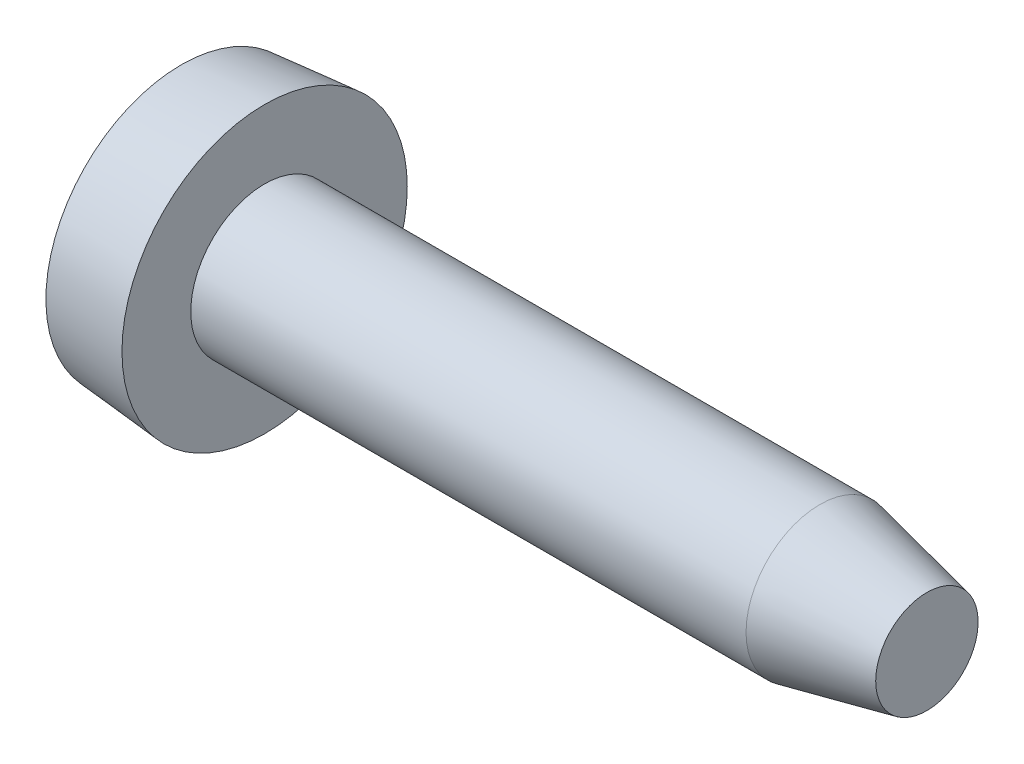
ISO-10303-21;
HEADER;
FILE_DESCRIPTION(('STEP AP214'),'2;1');
FILE_NAME('part.step','',(''),(''),'','','');
FILE_SCHEMA(('AUTOMOTIVE_DESIGN { 1 0 10303 214 1 1 1 1 }'));
ENDSEC;
DATA;
#1=APPLICATION_CONTEXT('core data for automotive mechanical design processes');
#2=APPLICATION_PROTOCOL_DEFINITION('international standard','automotive_design',2000,#1);
#3=PRODUCT_CONTEXT('',#1,'mechanical');
#4=PRODUCT('Part','Part','',(#3));
#5=PRODUCT_RELATED_PRODUCT_CATEGORY('part','',(#4));
#6=PRODUCT_DEFINITION_FORMATION('','',#4);
#7=PRODUCT_DEFINITION_CONTEXT('part definition',#1,'design');
#8=PRODUCT_DEFINITION('design','',#6,#7);
#9=PRODUCT_DEFINITION_SHAPE('','',#8);
#10=(LENGTH_UNIT() NAMED_UNIT(*) SI_UNIT(.MILLI.,.METRE.));
#11=(NAMED_UNIT(*) PLANE_ANGLE_UNIT() SI_UNIT($,.RADIAN.));
#12=(NAMED_UNIT(*) SI_UNIT($,.STERADIAN.) SOLID_ANGLE_UNIT());
#13=UNCERTAINTY_MEASURE_WITH_UNIT(LENGTH_MEASURE(1.E-05),#10,'distance_accuracy_value','');
#14=(GEOMETRIC_REPRESENTATION_CONTEXT(3) GLOBAL_UNCERTAINTY_ASSIGNED_CONTEXT((#13)) GLOBAL_UNIT_ASSIGNED_CONTEXT((#10,
#11,#12)) REPRESENTATION_CONTEXT('',''));
#15=CARTESIAN_POINT('',(0.,0.,0.));
#16=DIRECTION('',(0.,0.,1.));
#17=DIRECTION('',(1.,0.,0.));
#18=AXIS2_PLACEMENT_3D('',#15,#16,#17);
#19=CARTESIAN_POINT('',(-1.70366554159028,0.,-0.255));
#20=DIRECTION('',(0.,0.,1.));
#21=DIRECTION('',(1.,0.,0.));
#22=AXIS2_PLACEMENT_3D('',#19,#20,#21);
#23=PLANE('',#22);
#24=CARTESIAN_POINT('',(-2.38697804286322,-0.254999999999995,-0.255));
#25=CARTESIAN_POINT('',(-2.38080941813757,-0.375863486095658,-0.255000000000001));
#26=CARTESIAN_POINT('',(-2.37022720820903,-0.496488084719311,-0.255));
#27=CARTESIAN_POINT('',(-2.34040446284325,-0.736102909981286,-0.255));
#28=CARTESIAN_POINT('',(-2.321203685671,-0.855098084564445,-0.254999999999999));
#29=CARTESIAN_POINT('',(-2.26269549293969,-1.14959225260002,-0.255));
#30=CARTESIAN_POINT('',(-2.21814295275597,-1.32406276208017,-0.255000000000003));
#31=CARTESIAN_POINT('',(-2.16423628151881,-1.4956696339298,-0.25500000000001));
#32=B_SPLINE_CURVE_WITH_KNOTS('',3,(#24,#25,#26,#27,#28,#29,#30,#31),.UNSPECIFIED.,.F.,.F.,(4,2,
2,4),(0.,0.362956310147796,0.724255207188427,1.26345566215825),.UNSPECIFIED.);
#33=CARTESIAN_POINT('',(-2.38697804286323,-0.254999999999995,-0.255));
#34=VERTEX_POINT('',#33);
#35=CARTESIAN_POINT('',(-2.16423628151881,-1.49566963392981,-0.255000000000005));
#36=VERTEX_POINT('',#35);
#37=EDGE_CURVE('E19',#34,#36,#32,.T.);
#38=ORIENTED_EDGE('',*,*,#37,.T.);
#39=DIRECTION('',(0.78348098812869,0.621415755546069,0.));
#40=VECTOR('',#39,1.);
#41=CARTESIAN_POINT('',(-0.599999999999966,-0.254999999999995,-0.255));
#42=LINE('',#41,#40);
#43=CARTESIAN_POINT('',(-0.599999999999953,-0.254999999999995,-0.254999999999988));
#44=VERTEX_POINT('',#43);
#45=EDGE_CURVE('E79',#36,#44,#42,.T.);
#46=ORIENTED_EDGE('',*,*,#45,.T.);
#47=DIRECTION('',(1.,0.,0.));
#48=VECTOR('',#47,1.);
#49=CARTESIAN_POINT('',(-1.70366554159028,-0.254999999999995,-0.255));
#50=LINE('',#49,#48);
#51=EDGE_CURVE('E221',#44,#34,#50,.F.);
#52=ORIENTED_EDGE('',*,*,#51,.T.);
#53=EDGE_LOOP('',(#38,#46,#52));
#54=FACE_BOUND('',#53,.T.);
#55=ADVANCED_FACE('F15',(#54),#23,.T.);
#56=CARTESIAN_POINT('',(-1.70366554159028,-0.254999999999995,0.));
#57=DIRECTION('',(0.,-1.,0.));
#58=DIRECTION('',(0.,0.,-1.));
#59=AXIS2_PLACEMENT_3D('',#56,#57,#58);
#60=PLANE('',#59);
#61=ORIENTED_EDGE('',*,*,#51,.F.);
#62=DIRECTION('',(-0.78348098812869,0.,-0.621415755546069));
#63=VECTOR('',#62,1.);
#64=CARTESIAN_POINT('',(-0.599999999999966,-0.254999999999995,-0.254999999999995));
#65=LINE('',#64,#63);
#66=CARTESIAN_POINT('',(-2.16423628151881,-0.255,-1.49566963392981));
#67=VERTEX_POINT('',#66);
#68=EDGE_CURVE('E291',#44,#67,#65,.T.);
#69=ORIENTED_EDGE('',*,*,#68,.T.);
#70=CARTESIAN_POINT('',(-2.38697804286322,-0.254999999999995,-0.255));
#71=CARTESIAN_POINT('',(-2.38080941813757,-0.254999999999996,-0.375863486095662));
#72=CARTESIAN_POINT('',(-2.37022720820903,-0.254999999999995,-0.496488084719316));
#73=CARTESIAN_POINT('',(-2.34040446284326,-0.254999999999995,-0.736102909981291));
#74=CARTESIAN_POINT('',(-2.321203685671,-0.254999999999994,-0.85509808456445));
#75=CARTESIAN_POINT('',(-2.2626954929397,-0.254999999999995,-1.14959225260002));
#76=CARTESIAN_POINT('',(-2.21814295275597,-0.254999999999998,-1.32406276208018));
#77=CARTESIAN_POINT('',(-2.16423628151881,-0.255000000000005,-1.4956696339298));
#78=B_SPLINE_CURVE_WITH_KNOTS('',3,(#70,#71,#72,#73,#74,#75,#76,#77),.UNSPECIFIED.,.F.,.F.,(4,2,
2,4),(0.,0.362956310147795,0.724255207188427,1.26345566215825),.UNSPECIFIED.);
#79=EDGE_CURVE('E216',#34,#67,#78,.T.);
#80=ORIENTED_EDGE('',*,*,#79,.F.);
#81=EDGE_LOOP('',(#61,#69,#80));
#82=FACE_BOUND('',#81,.T.);
#83=ADVANCED_FACE('F222',(#82),#60,.F.);
#84=CARTESIAN_POINT('',(-0.599999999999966,-0.254999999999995,0.));
#85=DIRECTION('',(0.621415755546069,-0.78348098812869,0.));
#86=DIRECTION('',(0.78348098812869,0.621415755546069,0.));
#87=AXIS2_PLACEMENT_3D('',#84,#85,#86);
#88=PLANE('',#87);
#89=DIRECTION('',(0.783480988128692,0.621415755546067,0.));
#90=VECTOR('',#89,1.);
#91=CARTESIAN_POINT('',(-2.16423628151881,-1.49566963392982,0.255));
#92=LINE('',#91,#90);
#93=CARTESIAN_POINT('',(-2.16423628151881,-1.49566963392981,0.255000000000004));
#94=VERTEX_POINT('',#93);
#95=CARTESIAN_POINT('',(-0.599999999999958,-0.254999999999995,0.25500000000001));
#96=VERTEX_POINT('',#95);
#97=EDGE_CURVE('E330',#94,#96,#92,.T.);
#98=ORIENTED_EDGE('',*,*,#97,.T.);
#99=DIRECTION('',(0.,0.,1.));
#100=VECTOR('',#99,1.);
#101=CARTESIAN_POINT('',(-0.599999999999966,-0.254999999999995,0.));
#102=LINE('',#101,#100);
#103=EDGE_CURVE('E98',#44,#96,#102,.T.);
#104=ORIENTED_EDGE('',*,*,#103,.F.);
#105=ORIENTED_EDGE('',*,*,#45,.F.);
#106=CARTESIAN_POINT('',(-2.1642362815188,-1.49566963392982,0.255));
#107=CARTESIAN_POINT('',(-2.16787609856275,-1.49855654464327,0.17));
#108=CARTESIAN_POINT('',(-2.16969600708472,-1.5,0.0850000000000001));
#109=CARTESIAN_POINT('',(-2.16969600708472,-1.5,-0.0849999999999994));
#110=CARTESIAN_POINT('',(-2.16787609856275,-1.49855654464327,-0.169999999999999));
#111=CARTESIAN_POINT('',(-2.1642362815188,-1.49566963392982,-0.254999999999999));
#112=B_SPLINE_CURVE_WITH_KNOTS('',3,(#106,#107,#108,#109,#110,#111),.UNSPECIFIED.,.F.,.F.,(4,2,
4),(0.,0.255095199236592,0.510190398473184),.UNSPECIFIED.);
#113=EDGE_CURVE('E211',#94,#36,#112,.T.);
#114=ORIENTED_EDGE('',*,*,#113,.F.);
#115=EDGE_LOOP('',(#98,#104,#105,#114));
#116=FACE_BOUND('',#115,.T.);
#117=ADVANCED_FACE('F225',(#116),#88,.F.);
#118=CARTESIAN_POINT('',(-0.599999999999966,0.,-0.254999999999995));
#119=DIRECTION('',(0.621415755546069,0.,-0.78348098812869));
#120=DIRECTION('',(-0.78348098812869,0.,-0.621415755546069));
#121=AXIS2_PLACEMENT_3D('',#118,#119,#120);
#122=PLANE('',#121);
#123=ORIENTED_EDGE('',*,*,#68,.F.);
#124=DIRECTION('',(0.,1.,0.));
#125=VECTOR('',#124,1.);
#126=CARTESIAN_POINT('',(-0.599999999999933,0.,-0.254999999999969));
#127=LINE('',#126,#125);
#128=CARTESIAN_POINT('',(-0.599999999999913,0.254999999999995,-0.254999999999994));
#129=VERTEX_POINT('',#128);
#130=EDGE_CURVE('E289',#129,#44,#127,.F.);
#131=ORIENTED_EDGE('',*,*,#130,.F.);
#132=DIRECTION('',(0.783480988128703,0.,0.621415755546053));
#133=VECTOR('',#132,1.);
#134=CARTESIAN_POINT('',(-2.16423628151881,0.254999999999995,-1.49566963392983));
#135=LINE('',#134,#133);
#136=CARTESIAN_POINT('',(-2.16423628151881,0.254999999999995,-1.49566963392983));
#137=VERTEX_POINT('',#136);
#138=EDGE_CURVE('E323',#137,#129,#135,.T.);
#139=ORIENTED_EDGE('',*,*,#138,.F.);
#140=CARTESIAN_POINT('',(-2.16423628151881,-0.254999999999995,-1.49566963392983));
#141=CARTESIAN_POINT('',(-2.16787609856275,-0.169999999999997,-1.49855654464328));
#142=CARTESIAN_POINT('',(-2.16969600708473,-0.084999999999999,-1.5));
#143=CARTESIAN_POINT('',(-2.16969600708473,0.084999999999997,-1.5));
#144=CARTESIAN_POINT('',(-2.16787609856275,0.169999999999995,-1.49855654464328));
#145=CARTESIAN_POINT('',(-2.16423628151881,0.254999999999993,-1.49566963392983));
#146=B_SPLINE_CURVE_WITH_KNOTS('',3,(#140,#141,#142,#143,#144,#145),.UNSPECIFIED.,.F.,.F.,(4,2,
4),(0.,0.255095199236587,0.510190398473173),.UNSPECIFIED.);
#147=EDGE_CURVE('E205',#67,#137,#146,.T.);
#148=ORIENTED_EDGE('',*,*,#147,.F.);
#149=EDGE_LOOP('',(#123,#131,#139,#148));
#150=FACE_BOUND('',#149,.T.);
#151=ADVANCED_FACE('F230',(#150),#122,.F.);
#152=CARTESIAN_POINT('',(-1.70366554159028,0.,0.255));
#153=DIRECTION('',(0.,0.,1.));
#154=DIRECTION('',(1.,0.,0.));
#155=AXIS2_PLACEMENT_3D('',#152,#153,#154);
#156=PLANE('',#155);
#157=ORIENTED_EDGE('',*,*,#97,.F.);
#158=CARTESIAN_POINT('',(-2.38697804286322,-0.254999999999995,0.255));
#159=CARTESIAN_POINT('',(-2.38080941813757,-0.375863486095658,0.255));
#160=CARTESIAN_POINT('',(-2.37022720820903,-0.496488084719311,0.255));
#161=CARTESIAN_POINT('',(-2.34040446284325,-0.736102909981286,0.255));
#162=CARTESIAN_POINT('',(-2.321203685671,-0.855098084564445,0.255));
#163=CARTESIAN_POINT('',(-2.26269549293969,-1.14959225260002,0.255000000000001));
#164=CARTESIAN_POINT('',(-2.21814295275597,-1.32406276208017,0.255000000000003));
#165=CARTESIAN_POINT('',(-2.16423628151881,-1.4956696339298,0.255000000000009));
#166=B_SPLINE_CURVE_WITH_KNOTS('',3,(#158,#159,#160,#161,#162,#163,#164,#165),.UNSPECIFIED.,.F.,
.F.,(4,2,2,4),(0.,0.362956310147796,0.724255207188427,1.26345566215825),.UNSPECIFIED.);
#167=CARTESIAN_POINT('',(-2.38697804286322,-0.254999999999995,0.255));
#168=VERTEX_POINT('',#167);
#169=EDGE_CURVE('E198',#168,#94,#166,.T.);
#170=ORIENTED_EDGE('',*,*,#169,.F.);
#171=DIRECTION('',(1.,0.,0.));
#172=VECTOR('',#171,1.);
#173=CARTESIAN_POINT('',(-1.70366554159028,-0.254999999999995,0.255));
#174=LINE('',#173,#172);
#175=EDGE_CURVE('E320',#168,#96,#174,.T.);
#176=ORIENTED_EDGE('',*,*,#175,.T.);
#177=EDGE_LOOP('',(#157,#170,#176));
#178=FACE_BOUND('',#177,.T.);
#179=ADVANCED_FACE('F234',(#178),#156,.F.);
#180=CARTESIAN_POINT('',(-1.70366554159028,0.254999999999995,0.));
#181=DIRECTION('',(0.,-1.,0.));
#182=DIRECTION('',(0.,0.,-1.));
#183=AXIS2_PLACEMENT_3D('',#180,#181,#182);
#184=PLANE('',#183);
#185=ORIENTED_EDGE('',*,*,#138,.T.);
#186=DIRECTION('',(1.,0.,0.));
#187=VECTOR('',#186,1.);
#188=CARTESIAN_POINT('',(-1.70366554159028,0.254999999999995,-0.255));
#189=LINE('',#188,#187);
#190=CARTESIAN_POINT('',(-2.38697804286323,0.254999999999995,-0.255));
#191=VERTEX_POINT('',#190);
#192=EDGE_CURVE('E316',#191,#129,#189,.T.);
#193=ORIENTED_EDGE('',*,*,#192,.F.);
#194=CARTESIAN_POINT('',(-2.38697804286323,0.254999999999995,-0.255));
#195=CARTESIAN_POINT('',(-2.38080941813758,0.254999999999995,-0.375863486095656));
#196=CARTESIAN_POINT('',(-2.37022720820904,0.254999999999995,-0.496488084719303));
#197=CARTESIAN_POINT('',(-2.34040446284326,0.254999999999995,-0.736102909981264));
#198=CARTESIAN_POINT('',(-2.32120368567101,0.254999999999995,-0.855098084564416));
#199=CARTESIAN_POINT('',(-2.2626954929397,0.254999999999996,-1.1495922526));
#200=CARTESIAN_POINT('',(-2.21814295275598,0.254999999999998,-1.32406276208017));
#201=CARTESIAN_POINT('',(-2.16423628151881,0.255000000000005,-1.4956696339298));
#202=B_SPLINE_CURVE_WITH_KNOTS('',3,(#194,#195,#196,#197,#198,#199,#200,#201),.UNSPECIFIED.,.F.,
.F.,(4,2,2,4),(0.,0.362956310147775,0.724255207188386,1.26345566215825),.UNSPECIFIED.);
#203=EDGE_CURVE('E191',#191,#137,#202,.T.);
#204=ORIENTED_EDGE('',*,*,#203,.T.);
#205=EDGE_LOOP('',(#185,#193,#204));
#206=FACE_BOUND('',#205,.T.);
#207=ADVANCED_FACE('F238',(#206),#184,.T.);
#208=CARTESIAN_POINT('',(-1.70366554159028,-0.254999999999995,0.));
#209=DIRECTION('',(0.,-1.,0.));
#210=DIRECTION('',(0.,0.,-1.));
#211=AXIS2_PLACEMENT_3D('',#208,#209,#210);
#212=PLANE('',#211);
#213=DIRECTION('',(0.783480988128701,0.,-0.621415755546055));
#214=VECTOR('',#213,1.);
#215=CARTESIAN_POINT('',(-2.16969600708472,-0.254999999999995,1.5));
#216=LINE('',#215,#214);
#217=CARTESIAN_POINT('',(-2.16423628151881,-0.254999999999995,1.49566963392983));
#218=VERTEX_POINT('',#217);
#219=EDGE_CURVE('E103',#218,#96,#216,.T.);
#220=ORIENTED_EDGE('',*,*,#219,.T.);
#221=ORIENTED_EDGE('',*,*,#175,.F.);
#222=CARTESIAN_POINT('',(-2.16423628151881,-0.254999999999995,1.49566963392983));
#223=CARTESIAN_POINT('',(-2.21469075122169,-0.254999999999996,1.3350971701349));
#224=CARTESIAN_POINT('',(-2.25695855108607,-0.254999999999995,1.17192070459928));
#225=CARTESIAN_POINT('',(-2.32461908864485,-0.254999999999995,0.8431826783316));
#226=CARTESIAN_POINT('',(-2.35011698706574,-0.254999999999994,0.677642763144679));
#227=CARTESIAN_POINT('',(-2.37602868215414,-0.254999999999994,0.426031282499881));
#228=CARTESIAN_POINT('',(-2.38261125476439,-0.254999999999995,0.340564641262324));
#229=CARTESIAN_POINT('',(-2.38697804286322,-0.254999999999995,0.254999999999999));
#230=B_SPLINE_CURVE_WITH_KNOTS('',3,(#222,#223,#224,#225,#226,#227,#228,#229),.UNSPECIFIED.,.F.,
.F.,(4,2,2,4),(0.,0.504788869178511,1.00638133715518,1.26342207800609),.UNSPECIFIED.);
#231=EDGE_CURVE('E184',#218,#168,#230,.T.);
#232=ORIENTED_EDGE('',*,*,#231,.F.);
#233=EDGE_LOOP('',(#220,#221,#232));
#234=FACE_BOUND('',#233,.T.);
#235=ADVANCED_FACE('F242',(#234),#212,.F.);
#236=CARTESIAN_POINT('',(-0.599999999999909,0.254999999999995,0.));
#237=DIRECTION('',(1.,-1.114577E-13,0.));
#238=DIRECTION('',(1.114577E-13,1.,0.));
#239=AXIS2_PLACEMENT_3D('',#236,#237,#238);
#240=PLANE('',#239);
#241=DIRECTION('',(0.,0.,1.));
#242=VECTOR('',#241,1.);
#243=CARTESIAN_POINT('',(-0.599999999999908,0.254999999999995,0.));
#244=LINE('',#243,#242);
#245=CARTESIAN_POINT('',(-0.599999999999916,0.254999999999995,0.255000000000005));
#246=VERTEX_POINT('',#245);
#247=EDGE_CURVE('E95',#246,#129,#244,.F.);
#248=ORIENTED_EDGE('',*,*,#247,.T.);
#249=ORIENTED_EDGE('',*,*,#130,.T.);
#250=ORIENTED_EDGE('',*,*,#103,.T.);
#251=DIRECTION('',(0.,1.,0.));
#252=VECTOR('',#251,1.);
#253=CARTESIAN_POINT('',(-0.599999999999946,0.,0.255000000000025));
#254=LINE('',#253,#252);
#255=EDGE_CURVE('E90',#96,#246,#254,.T.);
#256=ORIENTED_EDGE('',*,*,#255,.T.);
#257=EDGE_LOOP('',(#248,#249,#250,#256));
#258=FACE_BOUND('',#257,.T.);
#259=ADVANCED_FACE('F92',(#258),#240,.F.);
#260=CARTESIAN_POINT('',(-1.70366554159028,0.,-0.255));
#261=DIRECTION('',(0.,0.,1.));
#262=DIRECTION('',(1.,0.,0.));
#263=AXIS2_PLACEMENT_3D('',#260,#261,#262);
#264=PLANE('',#263);
#265=DIRECTION('',(-0.783480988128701,0.621415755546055,0.));
#266=VECTOR('',#265,1.);
#267=CARTESIAN_POINT('',(-2.16969600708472,1.5,-0.255));
#268=LINE('',#267,#266);
#269=CARTESIAN_POINT('',(-2.16423628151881,1.49566963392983,-0.255));
#270=VERTEX_POINT('',#269);
#271=EDGE_CURVE('E121',#129,#270,#268,.T.);
#272=ORIENTED_EDGE('',*,*,#271,.T.);
#273=CARTESIAN_POINT('',(-2.16423628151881,1.49566963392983,-0.255));
#274=CARTESIAN_POINT('',(-2.21469075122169,1.33509717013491,-0.254999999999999));
#275=CARTESIAN_POINT('',(-2.25695855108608,1.17192070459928,-0.255));
#276=CARTESIAN_POINT('',(-2.32461908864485,0.843182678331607,-0.255000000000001));
#277=CARTESIAN_POINT('',(-2.35011698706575,0.677642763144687,-0.255000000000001));
#278=CARTESIAN_POINT('',(-2.37602868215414,0.426031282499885,-0.255000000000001));
#279=CARTESIAN_POINT('',(-2.38261125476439,0.340564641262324,-0.255000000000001));
#280=CARTESIAN_POINT('',(-2.38697804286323,0.254999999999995,-0.255));
#281=B_SPLINE_CURVE_WITH_KNOTS('',3,(#273,#274,#275,#276,#277,#278,#279,#280),.UNSPECIFIED.,.F.,
.F.,(4,2,2,4),(0.,0.504788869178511,1.00638133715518,1.26342207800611),.UNSPECIFIED.);
#282=EDGE_CURVE('E177',#270,#191,#281,.T.);
#283=ORIENTED_EDGE('',*,*,#282,.T.);
#284=ORIENTED_EDGE('',*,*,#192,.T.);
#285=EDGE_LOOP('',(#272,#283,#284));
#286=FACE_BOUND('',#285,.T.);
#287=ADVANCED_FACE('F249',(#286),#264,.T.);
#288=CARTESIAN_POINT('',(-2.16969600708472,0.,1.5));
#289=DIRECTION('',(0.621415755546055,0.,0.783480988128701));
#290=DIRECTION('',(0.783480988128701,0.,-0.621415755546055));
#291=AXIS2_PLACEMENT_3D('',#288,#289,#290);
#292=PLANE('',#291);
#293=DIRECTION('',(-0.783480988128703,0.,0.621415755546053));
#294=VECTOR('',#293,1.);
#295=CARTESIAN_POINT('',(-0.599999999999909,0.254999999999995,0.255));
#296=LINE('',#295,#294);
#297=CARTESIAN_POINT('',(-2.16423628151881,0.254999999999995,1.49566963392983));
#298=VERTEX_POINT('',#297);
#299=EDGE_CURVE('E107',#246,#298,#296,.T.);
#300=ORIENTED_EDGE('',*,*,#299,.F.);
#301=ORIENTED_EDGE('',*,*,#255,.F.);
#302=ORIENTED_EDGE('',*,*,#219,.F.);
#303=CARTESIAN_POINT('',(-2.16423628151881,0.254999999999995,1.49566963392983));
#304=CARTESIAN_POINT('',(-2.16787609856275,0.169999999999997,1.49855654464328));
#305=CARTESIAN_POINT('',(-2.16969600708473,0.0849999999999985,1.5));
#306=CARTESIAN_POINT('',(-2.16969600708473,-0.0849999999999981,1.5));
#307=CARTESIAN_POINT('',(-2.16787609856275,-0.169999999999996,1.49855654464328));
#308=CARTESIAN_POINT('',(-2.16423628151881,-0.254999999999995,1.49566963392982));
#309=B_SPLINE_CURVE_WITH_KNOTS('',3,(#303,#304,#305,#306,#307,#308),.UNSPECIFIED.,.F.,.F.,(4,2,
4),(0.,0.255095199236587,0.510190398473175),.UNSPECIFIED.);
#310=EDGE_CURVE('E102',#298,#218,#309,.T.);
#311=ORIENTED_EDGE('',*,*,#310,.F.);
#312=EDGE_LOOP('',(#300,#301,#302,#311));
#313=FACE_BOUND('',#312,.T.);
#314=ADVANCED_FACE('F108',(#313),#292,.F.);
#315=CARTESIAN_POINT('',(-2.16969600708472,1.5,0.));
#316=DIRECTION('',(0.621415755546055,0.783480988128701,0.));
#317=DIRECTION('',(-0.783480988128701,0.621415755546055,0.));
#318=AXIS2_PLACEMENT_3D('',#315,#316,#317);
#319=PLANE('',#318);
#320=ORIENTED_EDGE('',*,*,#271,.F.);
#321=ORIENTED_EDGE('',*,*,#247,.F.);
#322=DIRECTION('',(-0.783480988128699,0.621415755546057,0.));
#323=VECTOR('',#322,1.);
#324=CARTESIAN_POINT('',(-0.599999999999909,0.254999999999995,0.255));
#325=LINE('',#324,#323);
#326=CARTESIAN_POINT('',(-2.16423628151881,1.49566963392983,0.255));
#327=VERTEX_POINT('',#326);
#328=EDGE_CURVE('E112',#246,#327,#325,.T.);
#329=ORIENTED_EDGE('',*,*,#328,.T.);
#330=CARTESIAN_POINT('',(-2.16423628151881,1.49566963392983,-0.254999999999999));
#331=CARTESIAN_POINT('',(-2.16787609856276,1.49855654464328,-0.17));
#332=CARTESIAN_POINT('',(-2.16969600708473,1.5,-0.0849999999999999));
#333=CARTESIAN_POINT('',(-2.16969600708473,1.5,0.0849999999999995));
#334=CARTESIAN_POINT('',(-2.16787609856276,1.49855654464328,0.169999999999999));
#335=CARTESIAN_POINT('',(-2.16423628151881,1.49566963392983,0.254999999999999));
#336=B_SPLINE_CURVE_WITH_KNOTS('',3,(#330,#331,#332,#333,#334,#335),.UNSPECIFIED.,.F.,.F.,(4,2,
4),(0.,0.255095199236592,0.510190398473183),.UNSPECIFIED.);
#337=EDGE_CURVE('E39',#270,#327,#336,.T.);
#338=ORIENTED_EDGE('',*,*,#337,.F.);
#339=EDGE_LOOP('',(#320,#321,#329,#338));
#340=FACE_BOUND('',#339,.T.);
#341=ADVANCED_FACE('F117',(#340),#319,.F.);
#342=CARTESIAN_POINT('',(-1.70366554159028,0.254999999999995,0.));
#343=DIRECTION('',(0.,-1.,0.));
#344=DIRECTION('',(0.,0.,-1.));
#345=AXIS2_PLACEMENT_3D('',#342,#343,#344);
#346=PLANE('',#345);
#347=DIRECTION('',(1.,0.,0.));
#348=VECTOR('',#347,1.);
#349=CARTESIAN_POINT('',(-1.70366554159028,0.254999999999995,0.255));
#350=LINE('',#349,#348);
#351=CARTESIAN_POINT('',(-2.38697804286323,0.254999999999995,0.255));
#352=VERTEX_POINT('',#351);
#353=EDGE_CURVE('E124',#352,#246,#350,.T.);
#354=ORIENTED_EDGE('',*,*,#353,.T.);
#355=ORIENTED_EDGE('',*,*,#299,.T.);
#356=CARTESIAN_POINT('',(-2.16423628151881,0.254999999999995,1.49566963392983));
#357=CARTESIAN_POINT('',(-2.21469075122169,0.254999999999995,1.33509717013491));
#358=CARTESIAN_POINT('',(-2.25695855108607,0.254999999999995,1.17192070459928));
#359=CARTESIAN_POINT('',(-2.32461908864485,0.254999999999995,0.843182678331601));
#360=CARTESIAN_POINT('',(-2.35011698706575,0.254999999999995,0.67764276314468));
#361=CARTESIAN_POINT('',(-2.37602868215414,0.254999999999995,0.426031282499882));
#362=CARTESIAN_POINT('',(-2.38261125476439,0.254999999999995,0.340564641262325));
#363=CARTESIAN_POINT('',(-2.38697804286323,0.254999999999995,0.255));
#364=B_SPLINE_CURVE_WITH_KNOTS('',3,(#356,#357,#358,#359,#360,#361,#362,#363),.UNSPECIFIED.,.F.,
.F.,(4,2,2,4),(0.,0.504788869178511,1.00638133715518,1.26342207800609),.UNSPECIFIED.);
#365=EDGE_CURVE('E113',#298,#352,#364,.T.);
#366=ORIENTED_EDGE('',*,*,#365,.T.);
#367=EDGE_LOOP('',(#354,#355,#366));
#368=FACE_BOUND('',#367,.T.);
#369=ADVANCED_FACE('F125',(#368),#346,.T.);
#370=CARTESIAN_POINT('',(-1.70366554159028,0.,0.255));
#371=DIRECTION('',(0.,0.,1.));
#372=DIRECTION('',(1.,0.,0.));
#373=AXIS2_PLACEMENT_3D('',#370,#371,#372);
#374=PLANE('',#373);
#375=CARTESIAN_POINT('',(-2.16423628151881,1.49566963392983,0.255));
#376=CARTESIAN_POINT('',(-2.21469075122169,1.33509717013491,0.254999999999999));
#377=CARTESIAN_POINT('',(-2.25695855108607,1.17192070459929,0.255));
#378=CARTESIAN_POINT('',(-2.32461908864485,0.84318267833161,0.255));
#379=CARTESIAN_POINT('',(-2.35011698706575,0.677642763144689,0.255000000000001));
#380=CARTESIAN_POINT('',(-2.37602868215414,0.426031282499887,0.255000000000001));
#381=CARTESIAN_POINT('',(-2.38261125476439,0.340564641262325,0.255000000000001));
#382=CARTESIAN_POINT('',(-2.38697804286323,0.254999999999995,0.255));
#383=B_SPLINE_CURVE_WITH_KNOTS('',3,(#375,#376,#377,#378,#379,#380,#381,#382),.UNSPECIFIED.,.F.,
.F.,(4,2,2,4),(0.,0.504788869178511,1.00638133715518,1.26342207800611),.UNSPECIFIED.);
#384=EDGE_CURVE('E127',#327,#352,#383,.T.);
#385=ORIENTED_EDGE('',*,*,#384,.F.);
#386=ORIENTED_EDGE('',*,*,#328,.F.);
#387=ORIENTED_EDGE('',*,*,#353,.F.);
#388=EDGE_LOOP('',(#385,#386,#387));
#389=FACE_BOUND('',#388,.T.);
#390=ADVANCED_FACE('F129',(#389),#374,.F.);
#391=CARTESIAN_POINT('',(2.60000000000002,0.,0.));
#392=DIRECTION('',(1.,0.,0.));
#393=DIRECTION('',(0.,1.,0.));
#394=AXIS2_PLACEMENT_3D('',#391,#392,#393);
#395=SPHERICAL_SURFACE('',#394,5.00000000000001);
#396=CARTESIAN_POINT('',(-1.63566947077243,0.,0.));
#397=DIRECTION('',(1.,0.,0.));
#398=DIRECTION('',(0.,1.,0.));
#399=AXIS2_PLACEMENT_3D('',#396,#397,#398);
#400=CIRCLE('',#399,2.65689746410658);
#401=CARTESIAN_POINT('',(-1.63566947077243,2.65689746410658,0.));
#402=VERTEX_POINT('',#401);
#403=EDGE_CURVE('E138',#402,#402,#400,.T.);
#404=ORIENTED_EDGE('',*,*,#403,.F.);
#405=EDGE_LOOP('',(#404));
#406=FACE_BOUND('',#405,.T.);
#407=ORIENTED_EDGE('',*,*,#337,.T.);
#408=ORIENTED_EDGE('',*,*,#384,.T.);
#409=ORIENTED_EDGE('',*,*,#365,.F.);
#410=ORIENTED_EDGE('',*,*,#310,.T.);
#411=ORIENTED_EDGE('',*,*,#231,.T.);
#412=ORIENTED_EDGE('',*,*,#169,.T.);
#413=ORIENTED_EDGE('',*,*,#113,.T.);
#414=ORIENTED_EDGE('',*,*,#37,.F.);
#415=ORIENTED_EDGE('',*,*,#79,.T.);
#416=ORIENTED_EDGE('',*,*,#147,.T.);
#417=ORIENTED_EDGE('',*,*,#203,.F.);
#418=ORIENTED_EDGE('',*,*,#282,.F.);
#419=EDGE_LOOP('',(#407,#408,#409,#410,#411,#412,#413,#414,#415,#416,#417,#418));
#420=FACE_BOUND('',#419,.T.);
#421=ADVANCED_FACE('F140',(#406,#420),#395,.T.);
#422=CARTESIAN_POINT('',(13.,0.502499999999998,0.));
#423=DIRECTION('',(1.,0.,0.));
#424=DIRECTION('',(0.,0.,-1.));
#425=AXIS2_PLACEMENT_3D('',#422,#423,#424);
#426=PLANE('',#425);
#427=CARTESIAN_POINT('',(13.0000000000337,0.,0.));
#428=DIRECTION('',(-1.,0.,0.));
#429=DIRECTION('',(0.,0.,1.));
#430=AXIS2_PLACEMENT_3D('',#427,#428,#429);
#431=CIRCLE('',#430,1.00500000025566);
#432=CARTESIAN_POINT('',(13.0000000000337,0.,1.00500000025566));
#433=VERTEX_POINT('',#432);
#434=EDGE_CURVE('E279',#433,#433,#431,.T.);
#435=ORIENTED_EDGE('',*,*,#434,.F.);
#436=EDGE_LOOP('',(#435));
#437=FACE_BOUND('',#436,.T.);
#438=ADVANCED_FACE('F145',(#437),#426,.T.);
#439=CARTESIAN_POINT('',(-1.13686837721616E-10,0.,0.));
#440=DIRECTION('',(1.,0.,0.));
#441=DIRECTION('',(0.,0.,-1.));
#442=AXIS2_PLACEMENT_3D('',#439,#440,#441);
#443=CONICAL_SURFACE('',#442,2.7999999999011,0.0872664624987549);
#444=ORIENTED_EDGE('',*,*,#403,.T.);
#445=EDGE_LOOP('',(#444));
#446=FACE_BOUND('',#445,.T.);
#447=CARTESIAN_POINT('',(0.,0.,0.));
#448=DIRECTION('',(1.,0.,0.));
#449=DIRECTION('',(0.,0.,-1.));
#450=AXIS2_PLACEMENT_3D('',#447,#448,#449);
#451=CIRCLE('',#450,2.79999999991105);
#452=CARTESIAN_POINT('',(0.,0.,-2.79999999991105));
#453=VERTEX_POINT('',#452);
#454=EDGE_CURVE('E276',#453,#453,#451,.T.);
#455=ORIENTED_EDGE('',*,*,#454,.F.);
#456=EDGE_LOOP('',(#455));
#457=FACE_BOUND('',#456,.T.);
#458=ADVANCED_FACE('F415',(#446,#457),#443,.T.);
#459=CARTESIAN_POINT('',(10.9000000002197,0.,0.));
#460=DIRECTION('',(-1.,0.,0.));
#461=DIRECTION('',(0.,0.,1.));
#462=AXIS2_PLACEMENT_3D('',#459,#460,#461);
#463=CONICAL_SURFACE('',#462,1.44999999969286,0.208815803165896);
#464=CARTESIAN_POINT('',(10.8999999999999,0.,0.));
#465=DIRECTION('',(1.,0.,0.));
#466=DIRECTION('',(0.,0.,-1.));
#467=AXIS2_PLACEMENT_3D('',#464,#465,#466);
#468=CIRCLE('',#467,1.45000000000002);
#469=CARTESIAN_POINT('',(10.8999999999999,0.,-1.45000000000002));
#470=VERTEX_POINT('',#469);
#471=EDGE_CURVE('E30',#470,#470,#468,.F.);
#472=ORIENTED_EDGE('',*,*,#471,.F.);
#473=EDGE_LOOP('',(#472));
#474=FACE_BOUND('',#473,.T.);
#475=ORIENTED_EDGE('',*,*,#434,.T.);
#476=EDGE_LOOP('',(#475));
#477=FACE_BOUND('',#476,.T.);
#478=ADVANCED_FACE('F269',(#474,#477),#463,.T.);
#479=CARTESIAN_POINT('',(0.,2.12500000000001,0.));
#480=DIRECTION('',(1.,0.,0.));
#481=DIRECTION('',(0.,0.,-1.));
#482=AXIS2_PLACEMENT_3D('',#479,#480,#481);
#483=PLANE('',#482);
#484=CARTESIAN_POINT('',(0.,0.,0.));
#485=DIRECTION('',(1.,0.,0.));
#486=DIRECTION('',(0.,0.,-1.));
#487=AXIS2_PLACEMENT_3D('',#484,#485,#486);
#488=CIRCLE('',#487,1.45000000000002);
#489=CARTESIAN_POINT('',(0.,0.,-1.45000000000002));
#490=VERTEX_POINT('',#489);
#491=EDGE_CURVE('E10',#490,#490,#488,.T.);
#492=ORIENTED_EDGE('',*,*,#491,.F.);
#493=EDGE_LOOP('',(#492));
#494=FACE_BOUND('',#493,.T.);
#495=ORIENTED_EDGE('',*,*,#454,.T.);
#496=EDGE_LOOP('',(#495));
#497=FACE_BOUND('',#496,.T.);
#498=ADVANCED_FACE('F264',(#494,#497),#483,.T.);
#499=CARTESIAN_POINT('',(5.44999999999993,0.,0.));
#500=DIRECTION('',(1.,0.,0.));
#501=DIRECTION('',(0.,0.,-1.));
#502=AXIS2_PLACEMENT_3D('',#499,#500,#501);
#503=CYLINDRICAL_SURFACE('',#502,1.45000000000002);
#504=ORIENTED_EDGE('',*,*,#491,.T.);
#505=EDGE_LOOP('',(#504));
#506=FACE_BOUND('',#505,.T.);
#507=ORIENTED_EDGE('',*,*,#471,.T.);
#508=EDGE_LOOP('',(#507));
#509=FACE_BOUND('',#508,.T.);
#510=ADVANCED_FACE('F17',(#506,#509),#503,.T.);
#511=CLOSED_SHELL('',(#55,#83,#117,#151,#179,#207,#235,#259,#287,#314,#341,#369,#390,#421,#438,
#458,#478,#498,#510));
#512=MANIFOLD_SOLID_BREP('B1',#511);
#513=ADVANCED_BREP_SHAPE_REPRESENTATION('',(#18,#512),#14);
#514=SHAPE_DEFINITION_REPRESENTATION(#9,#513);
ENDSEC;
END-ISO-10303-21;
